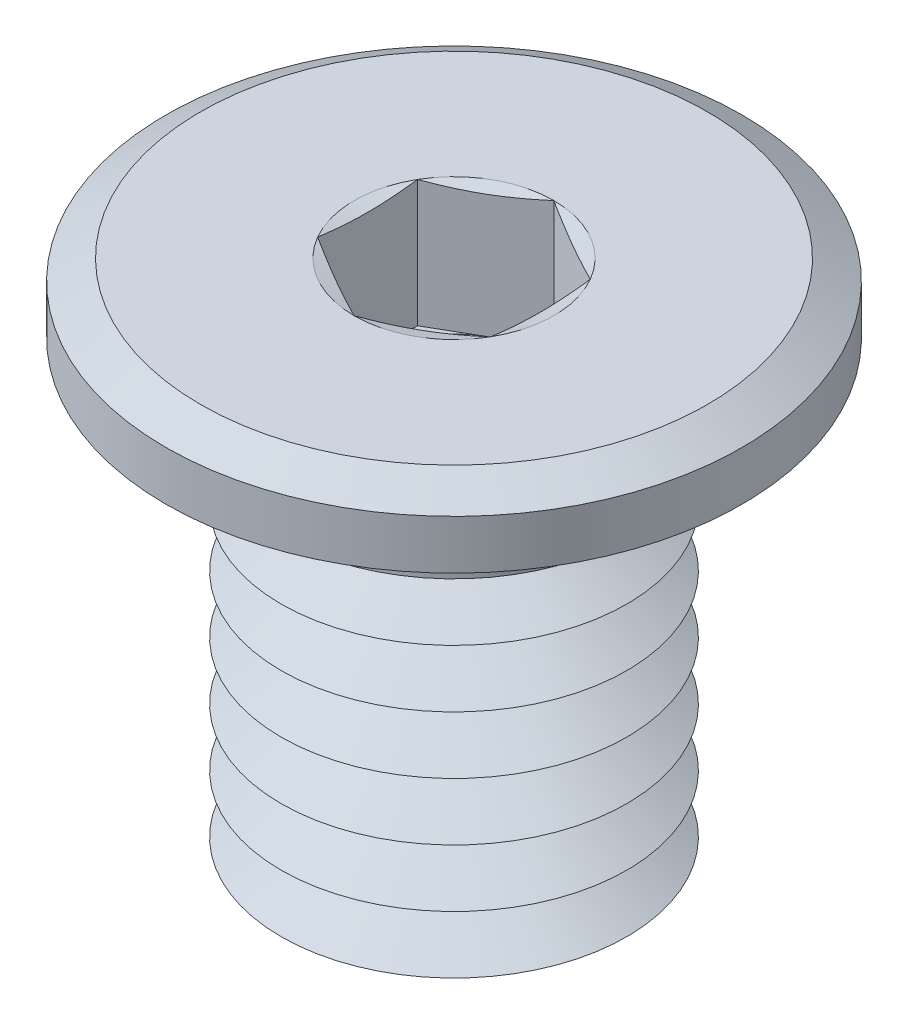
ISO-10303-21;
HEADER;
FILE_DESCRIPTION(('STEP AP214'),'2;1');
FILE_NAME('part.step','',(''),(''),'','','');
FILE_SCHEMA(('AUTOMOTIVE_DESIGN { 1 0 10303 214 1 1 1 1 }'));
ENDSEC;
DATA;
#1=APPLICATION_CONTEXT('core data for automotive mechanical design processes');
#2=APPLICATION_PROTOCOL_DEFINITION('international standard','automotive_design',2000,#1);
#3=PRODUCT_CONTEXT('',#1,'mechanical');
#4=PRODUCT('Part','Part','',(#3));
#5=PRODUCT_RELATED_PRODUCT_CATEGORY('part','',(#4));
#6=PRODUCT_DEFINITION_FORMATION('','',#4);
#7=PRODUCT_DEFINITION_CONTEXT('part definition',#1,'design');
#8=PRODUCT_DEFINITION('design','',#6,#7);
#9=PRODUCT_DEFINITION_SHAPE('','',#8);
#10=(LENGTH_UNIT() NAMED_UNIT(*) SI_UNIT(.MILLI.,.METRE.));
#11=(NAMED_UNIT(*) PLANE_ANGLE_UNIT() SI_UNIT($,.RADIAN.));
#12=(NAMED_UNIT(*) SI_UNIT($,.STERADIAN.) SOLID_ANGLE_UNIT());
#13=UNCERTAINTY_MEASURE_WITH_UNIT(LENGTH_MEASURE(1.E-05),#10,'distance_accuracy_value','');
#14=(GEOMETRIC_REPRESENTATION_CONTEXT(3) GLOBAL_UNCERTAINTY_ASSIGNED_CONTEXT((#13)) GLOBAL_UNIT_ASSIGNED_CONTEXT((#10,
#11,#12)) REPRESENTATION_CONTEXT('',''));
#15=CARTESIAN_POINT('',(0.,0.,0.));
#16=DIRECTION('',(0.,0.,1.));
#17=DIRECTION('',(1.,0.,0.));
#18=AXIS2_PLACEMENT_3D('',#15,#16,#17);
#19=CARTESIAN_POINT('',(0.,-7.7,0.));
#20=DIRECTION('',(0.,-1.,0.));
#21=DIRECTION('',(0.,0.,-1.));
#22=AXIS2_PLACEMENT_3D('',#19,#20,#21);
#23=CONICAL_SURFACE('',#22,3.,1.0471975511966);
#24=CARTESIAN_POINT('',(0.,-7.2,0.));
#25=DIRECTION('',(0.,1.,0.));
#26=DIRECTION('',(0.,0.,1.));
#27=AXIS2_PLACEMENT_3D('',#24,#25,#26);
#28=CIRCLE('',#27,2.13397459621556);
#29=CARTESIAN_POINT('',(0.,-7.2,2.13397459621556));
#30=VERTEX_POINT('',#29);
#31=EDGE_CURVE('E409',#30,#30,#28,.T.);
#32=ORIENTED_EDGE('',*,*,#31,.F.);
#33=EDGE_LOOP('',(#32));
#34=FACE_BOUND('',#33,.T.);
#35=CARTESIAN_POINT('',(0.,-7.7,0.));
#36=DIRECTION('',(0.,1.,0.));
#37=DIRECTION('',(0.,0.,1.));
#38=AXIS2_PLACEMENT_3D('',#35,#36,#37);
#39=CIRCLE('',#38,3.);
#40=CARTESIAN_POINT('',(0.,-7.7,3.));
#41=VERTEX_POINT('',#40);
#42=EDGE_CURVE('E413',#41,#41,#39,.T.);
#43=ORIENTED_EDGE('',*,*,#42,.T.);
#44=EDGE_LOOP('',(#43));
#45=FACE_BOUND('',#44,.T.);
#46=ADVANCED_FACE('F39',(#34,#45),#23,.T.);
#47=CARTESIAN_POINT('',(0.,-7.2,0.));
#48=DIRECTION('',(0.,1.,0.));
#49=DIRECTION('',(0.,0.,1.));
#50=AXIS2_PLACEMENT_3D('',#47,#48,#49);
#51=CONICAL_SURFACE('',#50,2.13397459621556,1.0471975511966);
#52=CARTESIAN_POINT('',(0.,-6.7,0.));
#53=DIRECTION('',(0.,1.,0.));
#54=DIRECTION('',(0.,0.,1.));
#55=AXIS2_PLACEMENT_3D('',#52,#53,#54);
#56=CIRCLE('',#55,3.);
#57=CARTESIAN_POINT('',(0.,-6.7,3.));
#58=VERTEX_POINT('',#57);
#59=EDGE_CURVE('E405',#58,#58,#56,.T.);
#60=ORIENTED_EDGE('',*,*,#59,.F.);
#61=EDGE_LOOP('',(#60));
#62=FACE_BOUND('',#61,.T.);
#63=ORIENTED_EDGE('',*,*,#31,.T.);
#64=EDGE_LOOP('',(#63));
#65=FACE_BOUND('',#64,.T.);
#66=ADVANCED_FACE('F233',(#62,#65),#51,.T.);
#67=CARTESIAN_POINT('',(0.,-9.2,0.));
#68=DIRECTION('',(0.,-1.,0.));
#69=DIRECTION('',(0.,0.,-1.));
#70=AXIS2_PLACEMENT_3D('',#67,#68,#69);
#71=PLANE('',#70);
#72=CARTESIAN_POINT('',(0.,-9.2,0.));
#73=DIRECTION('',(0.,1.,0.));
#74=DIRECTION('',(0.,0.,1.));
#75=AXIS2_PLACEMENT_3D('',#72,#73,#74);
#76=CIRCLE('',#75,2.13397459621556);
#77=CARTESIAN_POINT('',(0.,-9.2,2.13397459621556));
#78=VERTEX_POINT('',#77);
#79=EDGE_CURVE('E299',#78,#78,#76,.T.);
#80=ORIENTED_EDGE('',*,*,#79,.F.);
#81=EDGE_LOOP('',(#80));
#82=FACE_BOUND('',#81,.T.);
#83=ADVANCED_FACE('F239',(#82),#71,.T.);
#84=CARTESIAN_POINT('',(0.,-9.2,0.));
#85=DIRECTION('',(0.,1.,0.));
#86=DIRECTION('',(0.,0.,1.));
#87=AXIS2_PLACEMENT_3D('',#84,#85,#86);
#88=CONICAL_SURFACE('',#87,2.13397459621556,1.0471975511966);
#89=CARTESIAN_POINT('',(0.,-8.7,0.));
#90=DIRECTION('',(0.,1.,0.));
#91=DIRECTION('',(0.,0.,1.));
#92=AXIS2_PLACEMENT_3D('',#89,#90,#91);
#93=CIRCLE('',#92,3.);
#94=CARTESIAN_POINT('',(0.,-8.7,3.));
#95=VERTEX_POINT('',#94);
#96=EDGE_CURVE('E420',#95,#95,#93,.T.);
#97=ORIENTED_EDGE('',*,*,#96,.F.);
#98=EDGE_LOOP('',(#97));
#99=FACE_BOUND('',#98,.T.);
#100=ORIENTED_EDGE('',*,*,#79,.T.);
#101=EDGE_LOOP('',(#100));
#102=FACE_BOUND('',#101,.T.);
#103=ADVANCED_FACE('F254',(#99,#102),#88,.T.);
#104=CARTESIAN_POINT('',(0.,-8.7,0.));
#105=DIRECTION('',(0.,-1.,0.));
#106=DIRECTION('',(0.,0.,-1.));
#107=AXIS2_PLACEMENT_3D('',#104,#105,#106);
#108=CONICAL_SURFACE('',#107,3.,1.0471975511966);
#109=CARTESIAN_POINT('',(0.,-8.2,0.));
#110=DIRECTION('',(0.,1.,0.));
#111=DIRECTION('',(0.,0.,1.));
#112=AXIS2_PLACEMENT_3D('',#109,#110,#111);
#113=CIRCLE('',#112,2.13397459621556);
#114=CARTESIAN_POINT('',(0.,-8.2,2.13397459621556));
#115=VERTEX_POINT('',#114);
#116=EDGE_CURVE('E416',#115,#115,#113,.T.);
#117=ORIENTED_EDGE('',*,*,#116,.F.);
#118=EDGE_LOOP('',(#117));
#119=FACE_BOUND('',#118,.T.);
#120=ORIENTED_EDGE('',*,*,#96,.T.);
#121=EDGE_LOOP('',(#120));
#122=FACE_BOUND('',#121,.T.);
#123=ADVANCED_FACE('F250',(#119,#122),#108,.T.);
#124=CARTESIAN_POINT('',(0.,-8.2,0.));
#125=DIRECTION('',(0.,1.,0.));
#126=DIRECTION('',(0.,0.,1.));
#127=AXIS2_PLACEMENT_3D('',#124,#125,#126);
#128=CONICAL_SURFACE('',#127,2.13397459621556,1.0471975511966);
#129=ORIENTED_EDGE('',*,*,#42,.F.);
#130=EDGE_LOOP('',(#129));
#131=FACE_BOUND('',#130,.T.);
#132=ORIENTED_EDGE('',*,*,#116,.T.);
#133=EDGE_LOOP('',(#132));
#134=FACE_BOUND('',#133,.T.);
#135=ADVANCED_FACE('F246',(#131,#134),#128,.T.);
#136=CARTESIAN_POINT('',(0.,-6.7,0.));
#137=DIRECTION('',(0.,-1.,0.));
#138=DIRECTION('',(0.,0.,-1.));
#139=AXIS2_PLACEMENT_3D('',#136,#137,#138);
#140=CONICAL_SURFACE('',#139,3.,1.0471975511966);
#141=CARTESIAN_POINT('',(0.,-6.2,0.));
#142=DIRECTION('',(0.,1.,0.));
#143=DIRECTION('',(0.,0.,1.));
#144=AXIS2_PLACEMENT_3D('',#141,#142,#143);
#145=CIRCLE('',#144,2.13397459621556);
#146=CARTESIAN_POINT('',(0.,-6.2,2.13397459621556));
#147=VERTEX_POINT('',#146);
#148=EDGE_CURVE('E401',#147,#147,#145,.T.);
#149=ORIENTED_EDGE('',*,*,#148,.F.);
#150=EDGE_LOOP('',(#149));
#151=FACE_BOUND('',#150,.T.);
#152=ORIENTED_EDGE('',*,*,#59,.T.);
#153=EDGE_LOOP('',(#152));
#154=FACE_BOUND('',#153,.T.);
#155=ADVANCED_FACE('F249',(#151,#154),#140,.T.);
#156=CARTESIAN_POINT('',(0.,-6.2,0.));
#157=DIRECTION('',(0.,1.,0.));
#158=DIRECTION('',(0.,0.,1.));
#159=AXIS2_PLACEMENT_3D('',#156,#157,#158);
#160=CONICAL_SURFACE('',#159,2.13397459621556,1.0471975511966);
#161=CARTESIAN_POINT('',(0.,-5.7,0.));
#162=DIRECTION('',(0.,1.,0.));
#163=DIRECTION('',(0.,0.,1.));
#164=AXIS2_PLACEMENT_3D('',#161,#162,#163);
#165=CIRCLE('',#164,3.);
#166=CARTESIAN_POINT('',(0.,-5.7,3.));
#167=VERTEX_POINT('',#166);
#168=EDGE_CURVE('E398',#167,#167,#165,.T.);
#169=ORIENTED_EDGE('',*,*,#168,.F.);
#170=EDGE_LOOP('',(#169));
#171=FACE_BOUND('',#170,.T.);
#172=ORIENTED_EDGE('',*,*,#148,.T.);
#173=EDGE_LOOP('',(#172));
#174=FACE_BOUND('',#173,.T.);
#175=ADVANCED_FACE('F574',(#171,#174),#160,.T.);
#176=CARTESIAN_POINT('',(0.,-5.7,0.));
#177=DIRECTION('',(0.,-1.,0.));
#178=DIRECTION('',(0.,0.,-1.));
#179=AXIS2_PLACEMENT_3D('',#176,#177,#178);
#180=CONICAL_SURFACE('',#179,3.,1.0471975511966);
#181=CARTESIAN_POINT('',(0.,-5.2,0.));
#182=DIRECTION('',(0.,1.,0.));
#183=DIRECTION('',(0.,0.,1.));
#184=AXIS2_PLACEMENT_3D('',#181,#182,#183);
#185=CIRCLE('',#184,2.13397459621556);
#186=CARTESIAN_POINT('',(0.,-5.2,2.13397459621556));
#187=VERTEX_POINT('',#186);
#188=EDGE_CURVE('E395',#187,#187,#185,.T.);
#189=ORIENTED_EDGE('',*,*,#188,.F.);
#190=EDGE_LOOP('',(#189));
#191=FACE_BOUND('',#190,.T.);
#192=ORIENTED_EDGE('',*,*,#168,.T.);
#193=EDGE_LOOP('',(#192));
#194=FACE_BOUND('',#193,.T.);
#195=ADVANCED_FACE('F565',(#191,#194),#180,.T.);
#196=CARTESIAN_POINT('',(0.,-5.2,0.));
#197=DIRECTION('',(0.,1.,0.));
#198=DIRECTION('',(0.,0.,1.));
#199=AXIS2_PLACEMENT_3D('',#196,#197,#198);
#200=CONICAL_SURFACE('',#199,2.13397459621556,1.0471975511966);
#201=CARTESIAN_POINT('',(0.,-4.7,0.));
#202=DIRECTION('',(0.,1.,0.));
#203=DIRECTION('',(0.,0.,1.));
#204=AXIS2_PLACEMENT_3D('',#201,#202,#203);
#205=CIRCLE('',#204,3.);
#206=CARTESIAN_POINT('',(0.,-4.7,3.));
#207=VERTEX_POINT('',#206);
#208=EDGE_CURVE('E391',#207,#207,#205,.T.);
#209=ORIENTED_EDGE('',*,*,#208,.F.);
#210=EDGE_LOOP('',(#209));
#211=FACE_BOUND('',#210,.T.);
#212=ORIENTED_EDGE('',*,*,#188,.T.);
#213=EDGE_LOOP('',(#212));
#214=FACE_BOUND('',#213,.T.);
#215=ADVANCED_FACE('F556',(#211,#214),#200,.T.);
#216=CARTESIAN_POINT('',(0.,-4.7,0.));
#217=DIRECTION('',(0.,-1.,0.));
#218=DIRECTION('',(0.,0.,-1.));
#219=AXIS2_PLACEMENT_3D('',#216,#217,#218);
#220=CONICAL_SURFACE('',#219,3.,1.0471975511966);
#221=CARTESIAN_POINT('',(0.,-4.2,0.));
#222=DIRECTION('',(0.,1.,0.));
#223=DIRECTION('',(0.,0.,1.));
#224=AXIS2_PLACEMENT_3D('',#221,#222,#223);
#225=CIRCLE('',#224,2.13397459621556);
#226=CARTESIAN_POINT('',(0.,-4.2,2.13397459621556));
#227=VERTEX_POINT('',#226);
#228=EDGE_CURVE('E387',#227,#227,#225,.T.);
#229=ORIENTED_EDGE('',*,*,#228,.F.);
#230=EDGE_LOOP('',(#229));
#231=FACE_BOUND('',#230,.T.);
#232=ORIENTED_EDGE('',*,*,#208,.T.);
#233=EDGE_LOOP('',(#232));
#234=FACE_BOUND('',#233,.T.);
#235=ADVANCED_FACE('F547',(#231,#234),#220,.T.);
#236=CARTESIAN_POINT('',(0.,-4.2,0.));
#237=DIRECTION('',(0.,1.,0.));
#238=DIRECTION('',(0.,0.,1.));
#239=AXIS2_PLACEMENT_3D('',#236,#237,#238);
#240=CONICAL_SURFACE('',#239,2.13397459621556,1.0471975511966);
#241=CARTESIAN_POINT('',(0.,-3.7,0.));
#242=DIRECTION('',(0.,1.,0.));
#243=DIRECTION('',(0.,0.,1.));
#244=AXIS2_PLACEMENT_3D('',#241,#242,#243);
#245=CIRCLE('',#244,3.);
#246=CARTESIAN_POINT('',(0.,-3.7,3.));
#247=VERTEX_POINT('',#246);
#248=EDGE_CURVE('E383',#247,#247,#245,.T.);
#249=ORIENTED_EDGE('',*,*,#248,.F.);
#250=EDGE_LOOP('',(#249));
#251=FACE_BOUND('',#250,.T.);
#252=ORIENTED_EDGE('',*,*,#228,.T.);
#253=EDGE_LOOP('',(#252));
#254=FACE_BOUND('',#253,.T.);
#255=ADVANCED_FACE('F538',(#251,#254),#240,.T.);
#256=CARTESIAN_POINT('',(0.,-3.7,0.));
#257=DIRECTION('',(0.,-1.,0.));
#258=DIRECTION('',(0.,0.,-1.));
#259=AXIS2_PLACEMENT_3D('',#256,#257,#258);
#260=CONICAL_SURFACE('',#259,3.,1.0471975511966);
#261=CARTESIAN_POINT('',(0.,-3.2,0.));
#262=DIRECTION('',(0.,1.,0.));
#263=DIRECTION('',(0.,0.,1.));
#264=AXIS2_PLACEMENT_3D('',#261,#262,#263);
#265=CIRCLE('',#264,2.13397459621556);
#266=CARTESIAN_POINT('',(0.,-3.2,2.13397459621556));
#267=VERTEX_POINT('',#266);
#268=EDGE_CURVE('E379',#267,#267,#265,.T.);
#269=ORIENTED_EDGE('',*,*,#268,.F.);
#270=EDGE_LOOP('',(#269));
#271=FACE_BOUND('',#270,.T.);
#272=ORIENTED_EDGE('',*,*,#248,.T.);
#273=EDGE_LOOP('',(#272));
#274=FACE_BOUND('',#273,.T.);
#275=ADVANCED_FACE('F529',(#271,#274),#260,.T.);
#276=CARTESIAN_POINT('',(0.,-3.2,0.));
#277=DIRECTION('',(0.,1.,0.));
#278=DIRECTION('',(0.,0.,1.));
#279=AXIS2_PLACEMENT_3D('',#276,#277,#278);
#280=CONICAL_SURFACE('',#279,2.13397459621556,1.0471975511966);
#281=CARTESIAN_POINT('',(0.,-2.7,0.));
#282=DIRECTION('',(0.,1.,0.));
#283=DIRECTION('',(0.,0.,1.));
#284=AXIS2_PLACEMENT_3D('',#281,#282,#283);
#285=CIRCLE('',#284,3.);
#286=CARTESIAN_POINT('',(0.,-2.7,3.));
#287=VERTEX_POINT('',#286);
#288=EDGE_CURVE('E366',#287,#287,#285,.T.);
#289=ORIENTED_EDGE('',*,*,#288,.F.);
#290=EDGE_LOOP('',(#289));
#291=FACE_BOUND('',#290,.T.);
#292=ORIENTED_EDGE('',*,*,#268,.T.);
#293=EDGE_LOOP('',(#292));
#294=FACE_BOUND('',#293,.T.);
#295=ADVANCED_FACE('F274',(#291,#294),#280,.T.);
#296=CARTESIAN_POINT('',(0.,0.,0.));
#297=DIRECTION('',(0.,1.,0.));
#298=DIRECTION('',(0.,0.,1.));
#299=AXIS2_PLACEMENT_3D('',#296,#297,#298);
#300=PLANE('',#299);
#301=CARTESIAN_POINT('',(0.,0.,0.));
#302=DIRECTION('',(0.,1.,0.));
#303=DIRECTION('',(0.,0.,1.));
#304=AXIS2_PLACEMENT_3D('',#301,#302,#303);
#305=CIRCLE('',#304,1.73205080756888);
#306=CARTESIAN_POINT('',(0.,0.,1.73205080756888));
#307=VERTEX_POINT('',#306);
#308=CARTESIAN_POINT('',(1.5,0.,0.866025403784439));
#309=VERTEX_POINT('',#308);
#310=EDGE_CURVE('E66',#307,#309,#305,.T.);
#311=ORIENTED_EDGE('',*,*,#310,.F.);
#312=CARTESIAN_POINT('',(-1.5,0.,0.866025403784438));
#313=VERTEX_POINT('',#312);
#314=EDGE_CURVE('E169',#313,#307,#305,.T.);
#315=ORIENTED_EDGE('',*,*,#314,.F.);
#316=CARTESIAN_POINT('',(-1.5,0.,-0.86602540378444));
#317=VERTEX_POINT('',#316);
#318=EDGE_CURVE('E164',#317,#313,#305,.T.);
#319=ORIENTED_EDGE('',*,*,#318,.F.);
#320=CARTESIAN_POINT('',(0.,0.,-1.73205080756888));
#321=VERTEX_POINT('',#320);
#322=EDGE_CURVE('E128',#321,#317,#305,.T.);
#323=ORIENTED_EDGE('',*,*,#322,.F.);
#324=CARTESIAN_POINT('',(1.5,0.,-0.86602540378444));
#325=VERTEX_POINT('',#324);
#326=EDGE_CURVE('E119',#325,#321,#305,.T.);
#327=ORIENTED_EDGE('',*,*,#326,.F.);
#328=EDGE_CURVE('E59',#309,#325,#305,.T.);
#329=ORIENTED_EDGE('',*,*,#328,.F.);
#330=EDGE_LOOP('',(#311,#315,#319,#323,#327,#329));
#331=FACE_BOUND('',#330,.T.);
#332=CARTESIAN_POINT('',(0.,0.,0.));
#333=DIRECTION('',(0.,1.,0.));
#334=DIRECTION('',(0.,0.,1.));
#335=AXIS2_PLACEMENT_3D('',#332,#333,#334);
#336=CIRCLE('',#335,4.4);
#337=CARTESIAN_POINT('',(0.,0.,4.4));
#338=VERTEX_POINT('',#337);
#339=EDGE_CURVE('E295',#338,#338,#336,.T.);
#340=ORIENTED_EDGE('',*,*,#339,.T.);
#341=EDGE_LOOP('',(#340));
#342=FACE_BOUND('',#341,.T.);
#343=ADVANCED_FACE('F160',(#331,#342),#300,.T.);
#344=CARTESIAN_POINT('',(0.,-1.2,0.));
#345=DIRECTION('',(0.,1.,0.));
#346=DIRECTION('',(0.,0.,1.));
#347=AXIS2_PLACEMENT_3D('',#344,#345,#346);
#348=CYLINDRICAL_SURFACE('',#347,5.);
#349=CARTESIAN_POINT('',(0.,-0.346410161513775,0.));
#350=DIRECTION('',(0.,1.,0.));
#351=DIRECTION('',(0.,0.,1.));
#352=AXIS2_PLACEMENT_3D('',#349,#350,#351);
#353=CIRCLE('',#352,5.);
#354=CARTESIAN_POINT('',(0.,-0.346410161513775,5.));
#355=VERTEX_POINT('',#354);
#356=EDGE_CURVE('E305',#355,#355,#353,.F.);
#357=ORIENTED_EDGE('',*,*,#356,.T.);
#358=EDGE_LOOP('',(#357));
#359=FACE_BOUND('',#358,.T.);
#360=CARTESIAN_POINT('',(0.,-1.2,0.));
#361=DIRECTION('',(0.,1.,0.));
#362=DIRECTION('',(0.,0.,1.));
#363=AXIS2_PLACEMENT_3D('',#360,#361,#362);
#364=CIRCLE('',#363,5.);
#365=CARTESIAN_POINT('',(0.,-1.2,5.));
#366=VERTEX_POINT('',#365);
#367=EDGE_CURVE('E291',#366,#366,#364,.T.);
#368=ORIENTED_EDGE('',*,*,#367,.T.);
#369=EDGE_LOOP('',(#368));
#370=FACE_BOUND('',#369,.T.);
#371=ADVANCED_FACE('F270',(#359,#370),#348,.T.);
#372=CARTESIAN_POINT('',(0.,-1.2,0.));
#373=DIRECTION('',(0.,1.,0.));
#374=DIRECTION('',(0.,0.,1.));
#375=AXIS2_PLACEMENT_3D('',#372,#373,#374);
#376=PLANE('',#375);
#377=CARTESIAN_POINT('',(0.,-1.2,0.));
#378=DIRECTION('',(0.,1.,0.));
#379=DIRECTION('',(0.,0.,1.));
#380=AXIS2_PLACEMENT_3D('',#377,#378,#379);
#381=CIRCLE('',#380,3.25);
#382=CARTESIAN_POINT('',(0.,-1.2,3.25));
#383=VERTEX_POINT('',#382);
#384=EDGE_CURVE('E286',#383,#383,#381,.T.);
#385=ORIENTED_EDGE('',*,*,#384,.T.);
#386=EDGE_LOOP('',(#385));
#387=FACE_BOUND('',#386,.T.);
#388=ORIENTED_EDGE('',*,*,#367,.F.);
#389=EDGE_LOOP('',(#388));
#390=FACE_BOUND('',#389,.T.);
#391=ADVANCED_FACE('F266',(#387,#390),#376,.F.);
#392=CARTESIAN_POINT('',(0.,-9.2,0.));
#393=DIRECTION('',(0.,1.,0.));
#394=DIRECTION('',(0.,0.,1.));
#395=AXIS2_PLACEMENT_3D('',#392,#393,#394);
#396=CYLINDRICAL_SURFACE('',#395,3.);
#397=CARTESIAN_POINT('',(0.,-1.45,0.));
#398=DIRECTION('',(0.,1.,0.));
#399=DIRECTION('',(0.,0.,1.));
#400=AXIS2_PLACEMENT_3D('',#397,#398,#399);
#401=CIRCLE('',#400,3.);
#402=CARTESIAN_POINT('',(0.,-1.45,3.));
#403=VERTEX_POINT('',#402);
#404=EDGE_CURVE('E289',#403,#403,#401,.F.);
#405=ORIENTED_EDGE('',*,*,#404,.T.);
#406=EDGE_LOOP('',(#405));
#407=FACE_BOUND('',#406,.T.);
#408=ORIENTED_EDGE('',*,*,#288,.T.);
#409=EDGE_LOOP('',(#408));
#410=FACE_BOUND('',#409,.T.);
#411=ADVANCED_FACE('F262',(#407,#410),#396,.T.);
#412=CARTESIAN_POINT('',(0.,-1.45,0.));
#413=DIRECTION('',(0.,1.,0.));
#414=DIRECTION('',(0.,0.,1.));
#415=AXIS2_PLACEMENT_3D('',#412,#413,#414);
#416=TOROIDAL_SURFACE('',#415,3.25,0.25);
#417=ORIENTED_EDGE('',*,*,#384,.F.);
#418=EDGE_LOOP('',(#417));
#419=FACE_BOUND('',#418,.T.);
#420=ORIENTED_EDGE('',*,*,#404,.F.);
#421=EDGE_LOOP('',(#420));
#422=FACE_BOUND('',#421,.T.);
#423=ADVANCED_FACE('F265',(#419,#422),#416,.F.);
#424=CARTESIAN_POINT('',(0.,0.,0.));
#425=DIRECTION('',(0.,-1.,0.));
#426=DIRECTION('',(0.,0.,-1.));
#427=AXIS2_PLACEMENT_3D('',#424,#425,#426);
#428=CONICAL_SURFACE('',#427,4.4,1.0471975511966);
#429=ORIENTED_EDGE('',*,*,#356,.F.);
#430=EDGE_LOOP('',(#429));
#431=FACE_BOUND('',#430,.T.);
#432=ORIENTED_EDGE('',*,*,#339,.F.);
#433=EDGE_LOOP('',(#432));
#434=FACE_BOUND('',#433,.T.);
#435=ADVANCED_FACE('F41',(#431,#434),#428,.T.);
#436=CARTESIAN_POINT('',(0.,0.,0.));
#437=DIRECTION('',(0.,1.,0.));
#438=DIRECTION('',(0.,0.,1.));
#439=AXIS2_PLACEMENT_3D('',#436,#437,#438);
#440=CONICAL_SURFACE('',#439,1.73205080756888,1.30899693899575);
#441=ORIENTED_EDGE('',*,*,#322,.T.);
#442=CARTESIAN_POINT('',(0.000199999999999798,3.09432014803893E-05,-1.73216627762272));
#443=CARTESIAN_POINT('',(-0.0621077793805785,-0.00961367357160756,-1.69619286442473));
#444=CARTESIAN_POINT('',(-0.124528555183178,-0.0183695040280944,-1.66015421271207));
#445=CARTESIAN_POINT('',(-0.249590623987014,-0.0337528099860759,-1.58794959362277));
#446=CARTESIAN_POINT('',(-0.312231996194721,-0.0403794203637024,-1.55178358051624));
#447=CARTESIAN_POINT('',(-0.437355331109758,-0.0511173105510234,-1.47954358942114));
#448=CARTESIAN_POINT('',(-0.499836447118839,-0.0552413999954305,-1.44347010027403));
#449=CARTESIAN_POINT('',(-0.624878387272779,-0.0607713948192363,-1.37127710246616));
#450=CARTESIAN_POINT('',(-0.68743919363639,-0.0621778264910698,-1.33515760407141));
#451=CARTESIAN_POINT('',(-0.81256080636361,-0.0621778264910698,-1.26291860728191));
#452=CARTESIAN_POINT('',(-0.875121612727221,-0.0607713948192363,-1.22679910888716));
#453=CARTESIAN_POINT('',(-1.00016355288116,-0.0552413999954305,-1.15460611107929));
#454=CARTESIAN_POINT('',(-1.06264466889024,-0.0511173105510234,-1.11853262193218));
#455=CARTESIAN_POINT('',(-1.18776800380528,-0.0403794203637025,-1.04629263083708));
#456=CARTESIAN_POINT('',(-1.25040937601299,-0.0337528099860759,-1.01012661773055));
#457=CARTESIAN_POINT('',(-1.37547144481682,-0.0183695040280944,-0.937921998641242));
#458=CARTESIAN_POINT('',(-1.43789222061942,-0.00961367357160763,-0.901883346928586));
#459=CARTESIAN_POINT('',(-1.5002,3.09432014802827E-05,-0.865909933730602));
#460=B_SPLINE_CURVE_WITH_KNOTS('',3,(#442,#443,#444,#445,#446,#447,#448,#449,#450,#451,#452,
#453,#454,#455,#456,#457,#458,#459),.UNSPECIFIED.,.F.,.F.,(4,2,2,2,2,2,2,2,4),(0.,
0.217782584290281,0.435653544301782,0.652399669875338,0.869103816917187,1.08580796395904,
1.30255408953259,1.52042504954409,1.73820763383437),.UNSPECIFIED.);
#461=EDGE_CURVE('E11',#321,#317,#460,.T.);
#462=ORIENTED_EDGE('',*,*,#461,.F.);
#463=EDGE_LOOP('',(#441,#462));
#464=FACE_BOUND('',#463,.T.);
#465=ADVANCED_FACE('F132',(#464),#440,.F.);
#466=ORIENTED_EDGE('',*,*,#318,.T.);
#467=CARTESIAN_POINT('',(-1.5,0.354011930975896,-2.65937634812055));
#468=CARTESIAN_POINT('',(-1.5,0.324139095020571,-2.53120070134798));
#469=CARTESIAN_POINT('',(-1.5,0.294685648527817,-2.40292071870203));
#470=CARTESIAN_POINT('',(-1.5,0.237197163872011,-2.14601955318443));
#471=CARTESIAN_POINT('',(-1.5,0.209162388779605,-2.01739831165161));
#472=CARTESIAN_POINT('',(-1.5,0.154839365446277,-1.7584759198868));
#473=CARTESIAN_POINT('',(-1.5,0.128570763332,-1.62817060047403));
#474=CARTESIAN_POINT('',(-1.5,0.079114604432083,-1.36695300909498));
#475=CARTESIAN_POINT('',(-1.5,0.0559273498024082,-1.23604067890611));
#476=CARTESIAN_POINT('',(-1.5,0.0147784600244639,-0.97706547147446));
#477=CARTESIAN_POINT('',(-1.5,-0.00330931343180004,-0.849023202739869));
#478=CARTESIAN_POINT('',(-1.5,-0.0330965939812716,-0.592203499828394));
#479=CARTESIAN_POINT('',(-1.5,-0.0447981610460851,-0.463426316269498));
#480=CARTESIAN_POINT('',(-1.5,-0.0597912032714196,-0.205943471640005));
#481=CARTESIAN_POINT('',(-1.5,-0.0631209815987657,-0.0772401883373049));
#482=CARTESIAN_POINT('',(-1.5,-0.0607624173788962,0.180089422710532));
#483=CARTESIAN_POINT('',(-1.5,-0.0550734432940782,0.30871574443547));
#484=CARTESIAN_POINT('',(-1.5,-0.038515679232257,0.529862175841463));
#485=CARTESIAN_POINT('',(-1.5,-0.0295136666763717,0.622533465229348));
#486=CARTESIAN_POINT('',(-1.5,-0.00818858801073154,0.807485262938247));
#487=CARTESIAN_POINT('',(-1.5,0.00413439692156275,0.89976578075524));
#488=CARTESIAN_POINT('',(-1.5,0.0313970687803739,1.08424538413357));
#489=CARTESIAN_POINT('',(-1.5,0.0463453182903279,1.17644317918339));
#490=CARTESIAN_POINT('',(-1.5,0.0781915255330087,1.36050255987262));
#491=CARTESIAN_POINT('',(-1.5,0.0950895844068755,1.45236412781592));
#492=CARTESIAN_POINT('',(-1.5,0.130717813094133,1.6377417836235));
#493=CARTESIAN_POINT('',(-1.5,0.149479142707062,1.73125183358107));
#494=CARTESIAN_POINT('',(-1.5,0.188141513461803,1.91803588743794));
#495=CARTESIAN_POINT('',(-1.5,0.208042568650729,2.01130988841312));
#496=CARTESIAN_POINT('',(-1.5,0.248588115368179,2.19713640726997));
#497=CARTESIAN_POINT('',(-1.5,0.269227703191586,2.28969000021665));
#498=CARTESIAN_POINT('',(-1.5,0.311169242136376,2.47464021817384));
#499=CARTESIAN_POINT('',(-1.5,0.332471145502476,2.56703685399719));
#500=CARTESIAN_POINT('',(-1.5,0.354011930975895,2.65937634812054));
#501=B_SPLINE_CURVE_WITH_KNOTS('',3,(#467,#468,#469,#470,#471,#472,#473,#474,#475,#476,#477,
#478,#479,#480,#481,#482,#483,#484,#485,#486,#487,#488,#489,#490,#491,#492,#493,#494,#495,#496,
#497,#498,#499,#500),.UNSPECIFIED.,.F.,.F.,(4,2,2,2,2,2,2,2,2,2,2,2,2,2,2,2,4),(0.,
0.3948412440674,0.789755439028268,1.18851185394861,1.58730734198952,1.97513907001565,
2.36284562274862,2.74877505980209,3.13473152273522,3.41398847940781,3.69323861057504,
3.97341705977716,4.25361004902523,4.53972148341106,4.82583644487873,5.1103147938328,
5.39477267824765),.UNSPECIFIED.);
#502=EDGE_CURVE('E172',#317,#313,#501,.T.);
#503=ORIENTED_EDGE('',*,*,#502,.F.);
#504=EDGE_LOOP('',(#466,#503));
#505=FACE_BOUND('',#504,.T.);
#506=ADVANCED_FACE('F485',(#505),#440,.F.);
#507=ORIENTED_EDGE('',*,*,#314,.T.);
#508=CARTESIAN_POINT('',(-1.5002,3.09432014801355E-05,0.8659099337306));
#509=CARTESIAN_POINT('',(-1.43789222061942,-0.00961367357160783,0.901883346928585));
#510=CARTESIAN_POINT('',(-1.37547144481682,-0.0183695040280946,0.937921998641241));
#511=CARTESIAN_POINT('',(-1.25040937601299,-0.0337528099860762,1.01012661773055));
#512=CARTESIAN_POINT('',(-1.18776800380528,-0.0403794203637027,1.04629263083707));
#513=CARTESIAN_POINT('',(-1.06264466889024,-0.0511173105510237,1.11853262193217));
#514=CARTESIAN_POINT('',(-1.00016355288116,-0.0552413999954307,1.15460611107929));
#515=CARTESIAN_POINT('',(-0.875121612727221,-0.0607713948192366,1.22679910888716));
#516=CARTESIAN_POINT('',(-0.81256080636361,-0.06217782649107,1.26291860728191));
#517=CARTESIAN_POINT('',(-0.68743919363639,-0.06217782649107,1.33515760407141));
#518=CARTESIAN_POINT('',(-0.624878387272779,-0.0607713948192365,1.37127710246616));
#519=CARTESIAN_POINT('',(-0.499836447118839,-0.0552413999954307,1.44347010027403));
#520=CARTESIAN_POINT('',(-0.437355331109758,-0.0511173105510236,1.47954358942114));
#521=CARTESIAN_POINT('',(-0.312231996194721,-0.0403794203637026,1.55178358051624));
#522=CARTESIAN_POINT('',(-0.249590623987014,-0.0337528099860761,1.58794959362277));
#523=CARTESIAN_POINT('',(-0.124528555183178,-0.0183695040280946,1.66015421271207));
#524=CARTESIAN_POINT('',(-0.0621077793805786,-0.00961367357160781,1.69619286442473));
#525=CARTESIAN_POINT('',(0.000199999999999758,3.09432014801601E-05,1.73216627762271));
#526=B_SPLINE_CURVE_WITH_KNOTS('',3,(#508,#509,#510,#511,#512,#513,#514,#515,#516,#517,#518,
#519,#520,#521,#522,#523,#524,#525),.UNSPECIFIED.,.F.,.F.,(4,2,2,2,2,2,2,2,4),(0.,
0.217782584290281,0.435653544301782,0.652399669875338,0.869103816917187,1.08580796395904,
1.30255408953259,1.52042504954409,1.73820763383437),.UNSPECIFIED.);
#527=EDGE_CURVE('E180',#313,#307,#526,.T.);
#528=ORIENTED_EDGE('',*,*,#527,.F.);
#529=EDGE_LOOP('',(#507,#528));
#530=FACE_BOUND('',#529,.T.);
#531=ADVANCED_FACE('F480',(#530),#440,.F.);
#532=ORIENTED_EDGE('',*,*,#310,.T.);
#533=CARTESIAN_POINT('',(-0.000199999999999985,3.09432014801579E-05,1.73216627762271));
#534=CARTESIAN_POINT('',(0.0621077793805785,-0.00961367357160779,1.69619286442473));
#535=CARTESIAN_POINT('',(0.124528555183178,-0.0183695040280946,1.66015421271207));
#536=CARTESIAN_POINT('',(0.249590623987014,-0.0337528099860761,1.58794959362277));
#537=CARTESIAN_POINT('',(0.312231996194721,-0.0403794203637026,1.55178358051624));
#538=CARTESIAN_POINT('',(0.437355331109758,-0.0511173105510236,1.47954358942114));
#539=CARTESIAN_POINT('',(0.499836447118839,-0.0552413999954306,1.44347010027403));
#540=CARTESIAN_POINT('',(0.624878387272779,-0.0607713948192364,1.37127710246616));
#541=CARTESIAN_POINT('',(0.687439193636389,-0.0621778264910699,1.33515760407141));
#542=CARTESIAN_POINT('',(0.81256080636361,-0.0621778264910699,1.26291860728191));
#543=CARTESIAN_POINT('',(0.87512161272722,-0.0607713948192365,1.22679910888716));
#544=CARTESIAN_POINT('',(1.00016355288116,-0.0552413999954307,1.15460611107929));
#545=CARTESIAN_POINT('',(1.06264466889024,-0.0511173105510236,1.11853262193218));
#546=CARTESIAN_POINT('',(1.18776800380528,-0.0403794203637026,1.04629263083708));
#547=CARTESIAN_POINT('',(1.25040937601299,-0.0337528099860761,1.01012661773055));
#548=CARTESIAN_POINT('',(1.37547144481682,-0.0183695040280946,0.937921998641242));
#549=CARTESIAN_POINT('',(1.43789222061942,-0.00961367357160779,0.901883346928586));
#550=CARTESIAN_POINT('',(1.5002,3.09432014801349E-05,0.865909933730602));
#551=B_SPLINE_CURVE_WITH_KNOTS('',3,(#533,#534,#535,#536,#537,#538,#539,#540,#541,#542,#543,
#544,#545,#546,#547,#548,#549,#550),.UNSPECIFIED.,.F.,.F.,(4,2,2,2,2,2,2,2,4),(0.,
0.217782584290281,0.435653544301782,0.652399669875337,0.869103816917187,1.08580796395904,
1.30255408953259,1.52042504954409,1.73820763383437),.UNSPECIFIED.);
#552=EDGE_CURVE('E199',#307,#309,#551,.T.);
#553=ORIENTED_EDGE('',*,*,#552,.F.);
#554=EDGE_LOOP('',(#532,#553));
#555=FACE_BOUND('',#554,.T.);
#556=ADVANCED_FACE('F475',(#555),#440,.F.);
#557=ORIENTED_EDGE('',*,*,#328,.T.);
#558=CARTESIAN_POINT('',(1.5,0.354011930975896,2.65937634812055));
#559=CARTESIAN_POINT('',(1.5,0.324139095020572,2.53120070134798));
#560=CARTESIAN_POINT('',(1.5,0.294685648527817,2.40292071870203));
#561=CARTESIAN_POINT('',(1.5,0.237197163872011,2.14601955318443));
#562=CARTESIAN_POINT('',(1.5,0.209162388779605,2.01739831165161));
#563=CARTESIAN_POINT('',(1.5,0.154839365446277,1.7584759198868));
#564=CARTESIAN_POINT('',(1.5,0.128570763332,1.62817060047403));
#565=CARTESIAN_POINT('',(1.5,0.0791146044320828,1.36695300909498));
#566=CARTESIAN_POINT('',(1.5,0.055927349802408,1.23604067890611));
#567=CARTESIAN_POINT('',(1.5,0.0147784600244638,0.977065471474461));
#568=CARTESIAN_POINT('',(1.5,-0.00330931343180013,0.84902320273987));
#569=CARTESIAN_POINT('',(1.5,-0.0330965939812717,0.592203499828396));
#570=CARTESIAN_POINT('',(1.5,-0.0447981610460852,0.463426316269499));
#571=CARTESIAN_POINT('',(1.5,-0.0597912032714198,0.205943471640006));
#572=CARTESIAN_POINT('',(1.5,-0.0631209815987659,0.077240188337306));
#573=CARTESIAN_POINT('',(1.5,-0.0607624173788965,-0.18008942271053));
#574=CARTESIAN_POINT('',(1.5,-0.0550734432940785,-0.308715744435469));
#575=CARTESIAN_POINT('',(1.5,-0.0385156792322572,-0.529862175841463));
#576=CARTESIAN_POINT('',(1.5,-0.0295136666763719,-0.622533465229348));
#577=CARTESIAN_POINT('',(1.5,-0.00818858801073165,-0.807485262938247));
#578=CARTESIAN_POINT('',(1.5,0.00413439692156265,-0.89976578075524));
#579=CARTESIAN_POINT('',(1.5,0.0313970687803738,-1.08424538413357));
#580=CARTESIAN_POINT('',(1.5,0.0463453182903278,-1.17644317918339));
#581=CARTESIAN_POINT('',(1.5,0.0781915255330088,-1.36050255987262));
#582=CARTESIAN_POINT('',(1.5,0.0950895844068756,-1.45236412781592));
#583=CARTESIAN_POINT('',(1.5,0.130717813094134,-1.6377417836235));
#584=CARTESIAN_POINT('',(1.5,0.149479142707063,-1.73125183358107));
#585=CARTESIAN_POINT('',(1.5,0.188141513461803,-1.91803588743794));
#586=CARTESIAN_POINT('',(1.5,0.208042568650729,-2.01130988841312));
#587=CARTESIAN_POINT('',(1.5,0.248588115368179,-2.19713640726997));
#588=CARTESIAN_POINT('',(1.5,0.269227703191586,-2.28969000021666));
#589=CARTESIAN_POINT('',(1.5,0.311169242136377,-2.47464021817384));
#590=CARTESIAN_POINT('',(1.5,0.332471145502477,-2.5670368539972));
#591=CARTESIAN_POINT('',(1.5,0.354011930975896,-2.65937634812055));
#592=B_SPLINE_CURVE_WITH_KNOTS('',3,(#558,#559,#560,#561,#562,#563,#564,#565,#566,#567,#568,
#569,#570,#571,#572,#573,#574,#575,#576,#577,#578,#579,#580,#581,#582,#583,#584,#585,#586,#587,
#588,#589,#590,#591),.UNSPECIFIED.,.F.,.F.,(4,2,2,2,2,2,2,2,2,2,2,2,2,2,2,2,4),(0.,
0.3948412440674,0.789755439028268,1.18851185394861,1.58730734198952,1.97513907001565,
2.36284562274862,2.74877505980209,3.13473152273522,3.41398847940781,3.69323861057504,
3.97341705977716,4.25361004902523,4.53972148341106,4.82583644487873,5.1103147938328,
5.39477267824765),.UNSPECIFIED.);
#593=EDGE_CURVE('E149',#309,#325,#592,.T.);
#594=ORIENTED_EDGE('',*,*,#593,.F.);
#595=EDGE_LOOP('',(#557,#594));
#596=FACE_BOUND('',#595,.T.);
#597=ADVANCED_FACE('F192',(#596),#440,.F.);
#598=ORIENTED_EDGE('',*,*,#326,.T.);
#599=CARTESIAN_POINT('',(1.5002,3.09432014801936E-05,-0.865909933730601));
#600=CARTESIAN_POINT('',(1.43789222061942,-0.00961367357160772,-0.901883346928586));
#601=CARTESIAN_POINT('',(1.37547144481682,-0.0183695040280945,-0.937921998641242));
#602=CARTESIAN_POINT('',(1.25040937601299,-0.0337528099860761,-1.01012661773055));
#603=CARTESIAN_POINT('',(1.18776800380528,-0.0403794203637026,-1.04629263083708));
#604=CARTESIAN_POINT('',(1.06264466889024,-0.0511173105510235,-1.11853262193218));
#605=CARTESIAN_POINT('',(1.00016355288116,-0.0552413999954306,-1.15460611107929));
#606=CARTESIAN_POINT('',(0.87512161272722,-0.0607713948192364,-1.22679910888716));
#607=CARTESIAN_POINT('',(0.81256080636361,-0.0621778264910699,-1.26291860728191));
#608=CARTESIAN_POINT('',(0.687439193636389,-0.0621778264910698,-1.33515760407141));
#609=CARTESIAN_POINT('',(0.624878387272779,-0.0607713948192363,-1.37127710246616));
#610=CARTESIAN_POINT('',(0.499836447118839,-0.0552413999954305,-1.44347010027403));
#611=CARTESIAN_POINT('',(0.437355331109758,-0.0511173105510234,-1.47954358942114));
#612=CARTESIAN_POINT('',(0.312231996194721,-0.0403794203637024,-1.55178358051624));
#613=CARTESIAN_POINT('',(0.249590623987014,-0.0337528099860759,-1.58794959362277));
#614=CARTESIAN_POINT('',(0.124528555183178,-0.0183695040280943,-1.66015421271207));
#615=CARTESIAN_POINT('',(0.0621077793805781,-0.00961367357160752,-1.69619286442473));
#616=CARTESIAN_POINT('',(-0.00020000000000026,3.09432014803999E-05,-1.73216627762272));
#617=B_SPLINE_CURVE_WITH_KNOTS('',3,(#599,#600,#601,#602,#603,#604,#605,#606,#607,#608,#609,
#610,#611,#612,#613,#614,#615,#616),.UNSPECIFIED.,.F.,.F.,(4,2,2,2,2,2,2,2,4),(0.,
0.217782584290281,0.435653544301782,0.652399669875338,0.869103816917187,1.08580796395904,
1.30255408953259,1.52042504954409,1.73820763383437),.UNSPECIFIED.);
#618=EDGE_CURVE('E123',#325,#321,#617,.T.);
#619=ORIENTED_EDGE('',*,*,#618,.F.);
#620=EDGE_LOOP('',(#598,#619));
#621=FACE_BOUND('',#620,.T.);
#622=ADVANCED_FACE('F121',(#621),#440,.F.);
#623=CARTESIAN_POINT('',(0.,-2.2,0.));
#624=DIRECTION('',(0.,1.,0.));
#625=DIRECTION('',(0.,0.,1.));
#626=AXIS2_PLACEMENT_3D('',#623,#624,#625);
#627=CONICAL_SURFACE('',#626,1.5,1.0471975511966);
#628=CARTESIAN_POINT('',(0.,-3.06602540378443,0.));
#629=VERTEX_POINT('',#628);
#630=VERTEX_LOOP('',#629);
#631=FACE_BOUND('',#630,.T.);
#632=CARTESIAN_POINT('',(0.,-2.2,0.));
#633=DIRECTION('',(0.,1.,0.));
#634=DIRECTION('',(0.,0.,1.));
#635=AXIS2_PLACEMENT_3D('',#632,#633,#634);
#636=CIRCLE('',#635,1.5);
#637=CARTESIAN_POINT('',(0.75,-2.2,1.29903810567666));
#638=VERTEX_POINT('',#637);
#639=CARTESIAN_POINT('',(1.5,-2.2,0.));
#640=VERTEX_POINT('',#639);
#641=EDGE_CURVE('E148',#638,#640,#636,.T.);
#642=ORIENTED_EDGE('',*,*,#641,.T.);
#643=CARTESIAN_POINT('',(0.,-2.2,0.));
#644=DIRECTION('',(0.,1.,0.));
#645=DIRECTION('',(0.,0.,1.));
#646=AXIS2_PLACEMENT_3D('',#643,#644,#645);
#647=CIRCLE('',#646,1.5);
#648=CARTESIAN_POINT('',(0.75,-2.2,-1.29903810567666));
#649=VERTEX_POINT('',#648);
#650=EDGE_CURVE('E53',#640,#649,#647,.T.);
#651=ORIENTED_EDGE('',*,*,#650,.T.);
#652=CARTESIAN_POINT('',(-0.75,-2.2,-1.29903810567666));
#653=VERTEX_POINT('',#652);
#654=EDGE_CURVE('E318',#649,#653,#647,.T.);
#655=ORIENTED_EDGE('',*,*,#654,.T.);
#656=CARTESIAN_POINT('',(-1.5,-2.2,0.));
#657=VERTEX_POINT('',#656);
#658=EDGE_CURVE('E316',#653,#657,#647,.T.);
#659=ORIENTED_EDGE('',*,*,#658,.T.);
#660=CARTESIAN_POINT('',(-0.75,-2.2,1.29903810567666));
#661=VERTEX_POINT('',#660);
#662=EDGE_CURVE('E310',#657,#661,#647,.T.);
#663=ORIENTED_EDGE('',*,*,#662,.T.);
#664=EDGE_CURVE('E308',#661,#638,#647,.T.);
#665=ORIENTED_EDGE('',*,*,#664,.T.);
#666=EDGE_LOOP('',(#642,#651,#655,#659,#663,#665));
#667=FACE_BOUND('',#666,.T.);
#668=ADVANCED_FACE('F191',(#631,#667),#627,.F.);
#669=CARTESIAN_POINT('',(0.,-2.2,0.));
#670=DIRECTION('',(0.,1.,0.));
#671=DIRECTION('',(0.,0.,1.));
#672=AXIS2_PLACEMENT_3D('',#669,#670,#671);
#673=PLANE('',#672);
#674=ORIENTED_EDGE('',*,*,#650,.F.);
#675=DIRECTION('',(0.,0.,-1.));
#676=VECTOR('',#675,1.);
#677=CARTESIAN_POINT('',(1.5,-2.2,0.86602540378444));
#678=LINE('',#677,#676);
#679=CARTESIAN_POINT('',(1.5,-2.2,-0.866025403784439));
#680=VERTEX_POINT('',#679);
#681=EDGE_CURVE('E361',#640,#680,#678,.T.);
#682=ORIENTED_EDGE('',*,*,#681,.T.);
#683=DIRECTION('',(-0.866025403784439,0.,-0.5));
#684=VECTOR('',#683,1.);
#685=CARTESIAN_POINT('',(1.5,-2.2,-0.866025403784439));
#686=LINE('',#685,#684);
#687=EDGE_CURVE('E430',#680,#649,#686,.T.);
#688=ORIENTED_EDGE('',*,*,#687,.T.);
#689=EDGE_LOOP('',(#674,#682,#688));
#690=FACE_BOUND('',#689,.T.);
#691=ADVANCED_FACE('F438',(#690),#673,.T.);
#692=ORIENTED_EDGE('',*,*,#641,.F.);
#693=DIRECTION('',(0.866025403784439,0.,-0.5));
#694=VECTOR('',#693,1.);
#695=CARTESIAN_POINT('',(0.,-2.2,1.73205080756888));
#696=LINE('',#695,#694);
#697=CARTESIAN_POINT('',(1.5,-2.2,0.86602540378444));
#698=VERTEX_POINT('',#697);
#699=EDGE_CURVE('E356',#638,#698,#696,.T.);
#700=ORIENTED_EDGE('',*,*,#699,.T.);
#701=EDGE_CURVE('E157',#698,#640,#678,.T.);
#702=ORIENTED_EDGE('',*,*,#701,.T.);
#703=EDGE_LOOP('',(#692,#700,#702));
#704=FACE_BOUND('',#703,.T.);
#705=ADVANCED_FACE('F441',(#704),#673,.T.);
#706=ORIENTED_EDGE('',*,*,#664,.F.);
#707=DIRECTION('',(0.866025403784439,0.,0.5));
#708=VECTOR('',#707,1.);
#709=CARTESIAN_POINT('',(-1.5,-2.2,0.866025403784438));
#710=LINE('',#709,#708);
#711=CARTESIAN_POINT('',(0.,-2.2,1.73205080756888));
#712=VERTEX_POINT('',#711);
#713=EDGE_CURVE('E348',#661,#712,#710,.T.);
#714=ORIENTED_EDGE('',*,*,#713,.T.);
#715=EDGE_CURVE('E357',#712,#638,#696,.T.);
#716=ORIENTED_EDGE('',*,*,#715,.T.);
#717=EDGE_LOOP('',(#706,#714,#716));
#718=FACE_BOUND('',#717,.T.);
#719=ADVANCED_FACE('F220',(#718),#673,.T.);
#720=ORIENTED_EDGE('',*,*,#662,.F.);
#721=DIRECTION('',(0.,0.,1.));
#722=VECTOR('',#721,1.);
#723=CARTESIAN_POINT('',(-1.5,-2.2,-0.866025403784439));
#724=LINE('',#723,#722);
#725=CARTESIAN_POINT('',(-1.5,-2.2,0.866025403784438));
#726=VERTEX_POINT('',#725);
#727=EDGE_CURVE('E337',#657,#726,#724,.T.);
#728=ORIENTED_EDGE('',*,*,#727,.T.);
#729=EDGE_CURVE('E340',#726,#661,#710,.T.);
#730=ORIENTED_EDGE('',*,*,#729,.T.);
#731=EDGE_LOOP('',(#720,#728,#730));
#732=FACE_BOUND('',#731,.T.);
#733=ADVANCED_FACE('F336',(#732),#673,.T.);
#734=ORIENTED_EDGE('',*,*,#654,.F.);
#735=CARTESIAN_POINT('',(0.,-2.2,-1.73205080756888));
#736=VERTEX_POINT('',#735);
#737=EDGE_CURVE('E432',#649,#736,#686,.T.);
#738=ORIENTED_EDGE('',*,*,#737,.T.);
#739=DIRECTION('',(-0.866025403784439,0.,0.5));
#740=VECTOR('',#739,1.);
#741=CARTESIAN_POINT('',(0.,-2.2,-1.73205080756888));
#742=LINE('',#741,#740);
#743=EDGE_CURVE('E154',#736,#653,#742,.T.);
#744=ORIENTED_EDGE('',*,*,#743,.T.);
#745=EDGE_LOOP('',(#734,#738,#744));
#746=FACE_BOUND('',#745,.T.);
#747=ADVANCED_FACE('F453',(#746),#673,.T.);
#748=ORIENTED_EDGE('',*,*,#658,.F.);
#749=CARTESIAN_POINT('',(-1.5,-2.2,-0.866025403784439));
#750=VERTEX_POINT('',#749);
#751=EDGE_CURVE('E347',#653,#750,#742,.T.);
#752=ORIENTED_EDGE('',*,*,#751,.T.);
#753=EDGE_CURVE('E342',#750,#657,#724,.T.);
#754=ORIENTED_EDGE('',*,*,#753,.T.);
#755=EDGE_LOOP('',(#748,#752,#754));
#756=FACE_BOUND('',#755,.T.);
#757=ADVANCED_FACE('F346',(#756),#673,.T.);
#758=CARTESIAN_POINT('',(0.,-2.2,-1.73205080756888));
#759=DIRECTION('',(-0.5,0.,-0.866025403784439));
#760=DIRECTION('',(-0.866025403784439,0.,0.5));
#761=AXIS2_PLACEMENT_3D('',#758,#759,#760);
#762=PLANE('',#761);
#763=DIRECTION('',(0.,1.,0.));
#764=VECTOR('',#763,1.);
#765=CARTESIAN_POINT('',(0.,-2.2,-1.73205080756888));
#766=LINE('',#765,#764);
#767=EDGE_CURVE('E142',#736,#321,#766,.T.);
#768=ORIENTED_EDGE('',*,*,#767,.T.);
#769=ORIENTED_EDGE('',*,*,#461,.T.);
#770=DIRECTION('',(0.,1.,0.));
#771=VECTOR('',#770,1.);
#772=CARTESIAN_POINT('',(-1.5,-2.2,-0.866025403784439));
#773=LINE('',#772,#771);
#774=EDGE_CURVE('E156',#750,#317,#773,.T.);
#775=ORIENTED_EDGE('',*,*,#774,.F.);
#776=ORIENTED_EDGE('',*,*,#751,.F.);
#777=ORIENTED_EDGE('',*,*,#743,.F.);
#778=EDGE_LOOP('',(#768,#769,#775,#776,#777));
#779=FACE_BOUND('',#778,.T.);
#780=ADVANCED_FACE('F151',(#779),#762,.F.);
#781=CARTESIAN_POINT('',(-1.5,-2.2,-0.866025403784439));
#782=DIRECTION('',(-1.,0.,0.));
#783=DIRECTION('',(0.,0.,1.));
#784=AXIS2_PLACEMENT_3D('',#781,#782,#783);
#785=PLANE('',#784);
#786=ORIENTED_EDGE('',*,*,#774,.T.);
#787=ORIENTED_EDGE('',*,*,#502,.T.);
#788=DIRECTION('',(0.,1.,0.));
#789=VECTOR('',#788,1.);
#790=CARTESIAN_POINT('',(-1.5,-2.2,0.866025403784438));
#791=LINE('',#790,#789);
#792=EDGE_CURVE('E343',#726,#313,#791,.T.);
#793=ORIENTED_EDGE('',*,*,#792,.F.);
#794=ORIENTED_EDGE('',*,*,#727,.F.);
#795=ORIENTED_EDGE('',*,*,#753,.F.);
#796=EDGE_LOOP('',(#786,#787,#793,#794,#795));
#797=FACE_BOUND('',#796,.T.);
#798=ADVANCED_FACE('F186',(#797),#785,.F.);
#799=CARTESIAN_POINT('',(-1.5,-2.2,0.866025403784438));
#800=DIRECTION('',(-0.5,0.,0.866025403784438));
#801=DIRECTION('',(0.866025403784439,0.,0.5));
#802=AXIS2_PLACEMENT_3D('',#799,#800,#801);
#803=PLANE('',#802);
#804=ORIENTED_EDGE('',*,*,#792,.T.);
#805=ORIENTED_EDGE('',*,*,#527,.T.);
#806=DIRECTION('',(0.,1.,0.));
#807=VECTOR('',#806,1.);
#808=CARTESIAN_POINT('',(0.,-2.2,1.73205080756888));
#809=LINE('',#808,#807);
#810=EDGE_CURVE('E371',#712,#307,#809,.T.);
#811=ORIENTED_EDGE('',*,*,#810,.F.);
#812=ORIENTED_EDGE('',*,*,#713,.F.);
#813=ORIENTED_EDGE('',*,*,#729,.F.);
#814=EDGE_LOOP('',(#804,#805,#811,#812,#813));
#815=FACE_BOUND('',#814,.T.);
#816=ADVANCED_FACE('F223',(#815),#803,.F.);
#817=CARTESIAN_POINT('',(0.,-2.2,1.73205080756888));
#818=DIRECTION('',(0.5,0.,0.866025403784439));
#819=DIRECTION('',(0.866025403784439,0.,-0.5));
#820=AXIS2_PLACEMENT_3D('',#817,#818,#819);
#821=PLANE('',#820);
#822=ORIENTED_EDGE('',*,*,#810,.T.);
#823=ORIENTED_EDGE('',*,*,#552,.T.);
#824=DIRECTION('',(0.,1.,0.));
#825=VECTOR('',#824,1.);
#826=CARTESIAN_POINT('',(1.5,-2.2,0.86602540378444));
#827=LINE('',#826,#825);
#828=EDGE_CURVE('E367',#698,#309,#827,.T.);
#829=ORIENTED_EDGE('',*,*,#828,.F.);
#830=ORIENTED_EDGE('',*,*,#699,.F.);
#831=ORIENTED_EDGE('',*,*,#715,.F.);
#832=EDGE_LOOP('',(#822,#823,#829,#830,#831));
#833=FACE_BOUND('',#832,.T.);
#834=ADVANCED_FACE('F218',(#833),#821,.F.);
#835=CARTESIAN_POINT('',(1.5,-2.2,0.86602540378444));
#836=DIRECTION('',(1.,0.,0.));
#837=DIRECTION('',(0.,0.,-1.));
#838=AXIS2_PLACEMENT_3D('',#835,#836,#837);
#839=PLANE('',#838);
#840=ORIENTED_EDGE('',*,*,#828,.T.);
#841=ORIENTED_EDGE('',*,*,#593,.T.);
#842=DIRECTION('',(0.,1.,0.));
#843=VECTOR('',#842,1.);
#844=CARTESIAN_POINT('',(1.5,-2.2,-0.866025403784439));
#845=LINE('',#844,#843);
#846=EDGE_CURVE('E146',#680,#325,#845,.T.);
#847=ORIENTED_EDGE('',*,*,#846,.F.);
#848=ORIENTED_EDGE('',*,*,#681,.F.);
#849=ORIENTED_EDGE('',*,*,#701,.F.);
#850=EDGE_LOOP('',(#840,#841,#847,#848,#849));
#851=FACE_BOUND('',#850,.T.);
#852=ADVANCED_FACE('F215',(#851),#839,.F.);
#853=CARTESIAN_POINT('',(1.5,-2.2,-0.866025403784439));
#854=DIRECTION('',(0.5,0.,-0.866025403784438));
#855=DIRECTION('',(-0.866025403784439,0.,-0.5));
#856=AXIS2_PLACEMENT_3D('',#853,#854,#855);
#857=PLANE('',#856);
#858=ORIENTED_EDGE('',*,*,#846,.T.);
#859=ORIENTED_EDGE('',*,*,#618,.T.);
#860=ORIENTED_EDGE('',*,*,#767,.F.);
#861=ORIENTED_EDGE('',*,*,#737,.F.);
#862=ORIENTED_EDGE('',*,*,#687,.F.);
#863=EDGE_LOOP('',(#858,#859,#860,#861,#862));
#864=FACE_BOUND('',#863,.T.);
#865=ADVANCED_FACE('F140',(#864),#857,.F.);
#866=CLOSED_SHELL('',(#46,#66,#83,#103,#123,#135,#155,#175,#195,#215,#235,#255,#275,#295,#343,
#371,#391,#411,#423,#435,#465,#506,#531,#556,#597,#622,#668,#691,#705,#719,#733,#747,#757,#780,
#798,#816,#834,#852,#865));
#867=MANIFOLD_SOLID_BREP('B2',#866);
#868=ADVANCED_BREP_SHAPE_REPRESENTATION('',(#18,#867),#14);
#869=SHAPE_DEFINITION_REPRESENTATION(#9,#868);
ENDSEC;
END-ISO-10303-21;
